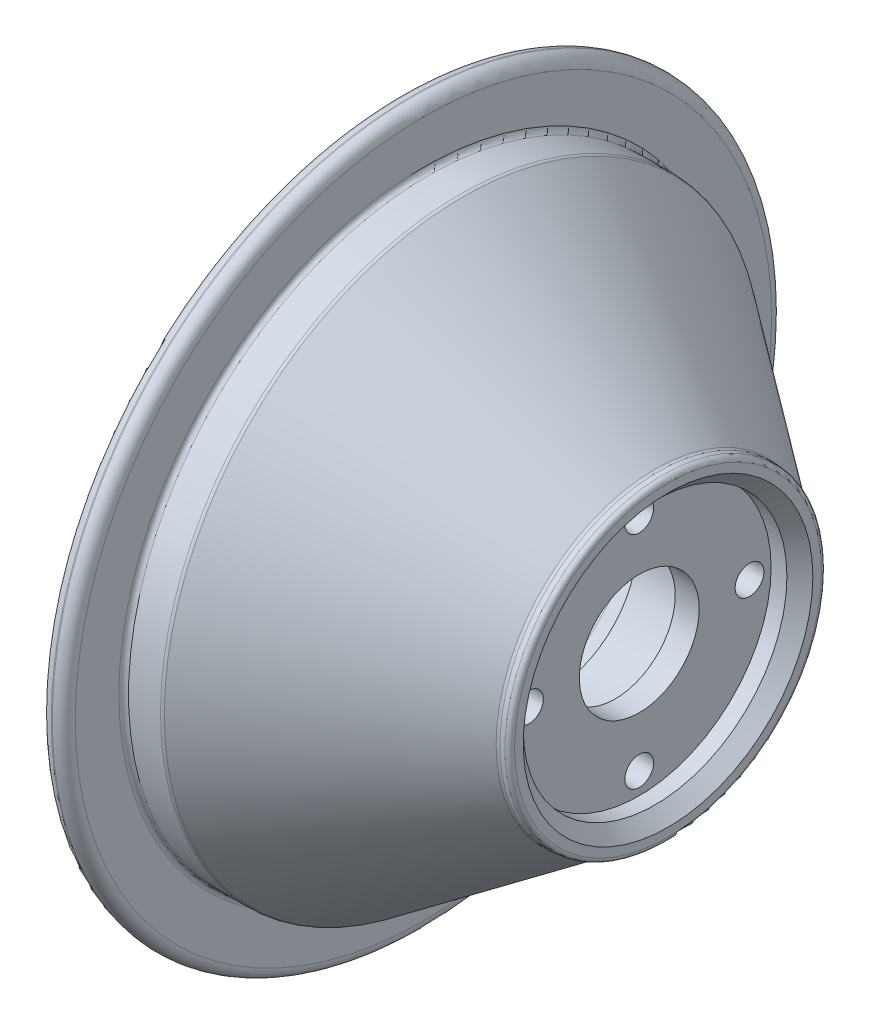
from build123d import *

# Parameters (mm, degrees)
CONG_1_R                = 2.4
CONG_2_R                = 1
ESQUISSE2_R             = 4.5
ENL_V_MAT_EXTRU_4_DEPTH = 6
ESQUISSE3_R             = 3
ENL_V_MAT_EXTRU_5_DEPTH = 113.667652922


with BuildPart() as part:
    # Esquisse1 → Base-R_volution (revolve)
    with BuildSketch(Plane.XY, mode=Mode.PRIVATE) as base_r_volution_sk:
        Polygon((0, 30.2), (0, 33), (-2.396733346, 33), (-43, 62.5), (-51, 62.5), (-51, 75), (-56, 75), (-56, 57.5), (-44.624598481, 57.5), (-18, 38.156096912), (-24, 29.89780539), (-24, 17.5), (-11, 17.5), (-11, 12.5), (-6, 12.5), (-6, 27.5), (-2.7, 27.5), align=None)
    revolve(base_r_volution_sk.sketch.rotate(Axis((0, 0, 0), (-1, 0, 0)), 90), axis=Axis((0, 0, 0), (-1, 0, 0)))

    # Cong_1
    cong_1_edges = [part.edges().sort_by_distance(p)[0] for p in [
        (-51, 0, 75),
        (-56, 0, 75),
    ]]
    fillet(cong_1_edges, radius=CONG_1_R)

    # Cong_2
    cong_2_edges = [part.edges().sort_by_distance(p)[0] for p in [
        (-51, 0, 62.5),
        (-43, 0, 62.5),
        (-2.396733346, 0, 33),
        (0, 0, 33),
        (-56, 0, 57.5),
        (-44.624598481, 0, 57.5),
        (-18, 0, 38.156096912),
        (-24, 0, 29.89780539),
    ]]
    fillet(cong_2_edges, radius=CONG_2_R)

    # Esquisse2 → Enl_v. mat.-Extru.4 (cut)
    with BuildSketch(Plane.ZY.offset(24)):
        with Locations((0, 23)):
            Circle(ESQUISSE2_R)
        with Locations((23, 0)):
            Circle(ESQUISSE2_R)
        with Locations((0, -23)):
            Circle(ESQUISSE2_R)
        with Locations((-23, 0)):
            Circle(ESQUISSE2_R)
    extrude(amount=-ENL_V_MAT_EXTRU_4_DEPTH, mode=Mode.SUBTRACT)

    # Esquisse3 → Enl_v. mat.-Extru.5 (cut, through all)
    with BuildSketch(Plane.ZY.offset(18)):
        with Locations((0, 23)):
            Circle(ESQUISSE3_R)
        with Locations((23, 0)):
            Circle(ESQUISSE3_R)
        with Locations((0, -23)):
            Circle(ESQUISSE3_R)
        with Locations((-23, 0)):
            Circle(ESQUISSE3_R)
    extrude(amount=-ENL_V_MAT_EXTRU_5_DEPTH, mode=Mode.SUBTRACT)


solid = part.part
